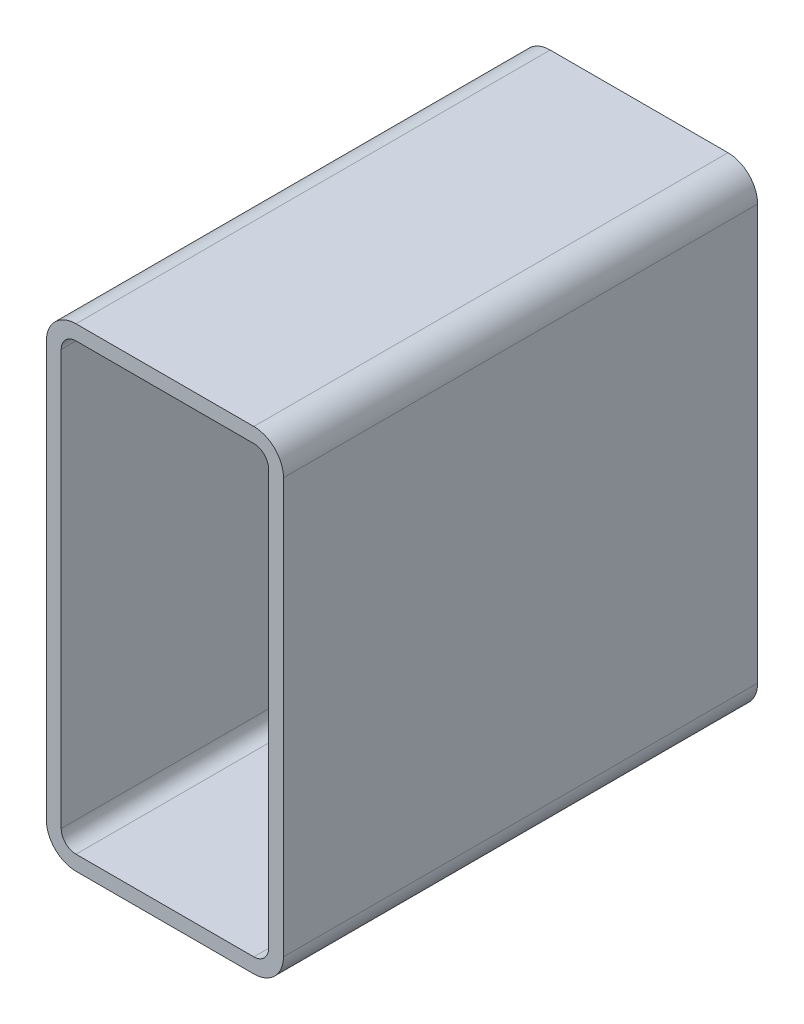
ISO-10303-21;
HEADER;
FILE_DESCRIPTION(('STEP AP214'),'2;1');
FILE_NAME('part.step','',(''),(''),'','','');
FILE_SCHEMA(('AUTOMOTIVE_DESIGN { 1 0 10303 214 1 1 1 1 }'));
ENDSEC;
DATA;
#1=APPLICATION_CONTEXT('core data for automotive mechanical design processes');
#2=APPLICATION_PROTOCOL_DEFINITION('international standard','automotive_design',2000,#1);
#3=PRODUCT_CONTEXT('',#1,'mechanical');
#4=PRODUCT('Part','Part','',(#3));
#5=PRODUCT_RELATED_PRODUCT_CATEGORY('part','',(#4));
#6=PRODUCT_DEFINITION_FORMATION('','',#4);
#7=PRODUCT_DEFINITION_CONTEXT('part definition',#1,'design');
#8=PRODUCT_DEFINITION('design','',#6,#7);
#9=PRODUCT_DEFINITION_SHAPE('','',#8);
#10=(LENGTH_UNIT() NAMED_UNIT(*) SI_UNIT(.MILLI.,.METRE.));
#11=(NAMED_UNIT(*) PLANE_ANGLE_UNIT() SI_UNIT($,.RADIAN.));
#12=(NAMED_UNIT(*) SI_UNIT($,.STERADIAN.) SOLID_ANGLE_UNIT());
#13=UNCERTAINTY_MEASURE_WITH_UNIT(LENGTH_MEASURE(1.E-05),#10,'distance_accuracy_value','');
#14=(GEOMETRIC_REPRESENTATION_CONTEXT(3) GLOBAL_UNCERTAINTY_ASSIGNED_CONTEXT((#13)) GLOBAL_UNIT_ASSIGNED_CONTEXT((#10,
#11,#12)) REPRESENTATION_CONTEXT('',''));
#15=CARTESIAN_POINT('',(0.,0.,0.));
#16=DIRECTION('',(0.,0.,1.));
#17=DIRECTION('',(1.,0.,0.));
#18=AXIS2_PLACEMENT_3D('',#15,#16,#17);
#19=CARTESIAN_POINT('',(19.0973013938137,287.624496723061,304.8));
#20=DIRECTION('',(0.,0.,1.));
#21=DIRECTION('',(1.,0.,0.));
#22=AXIS2_PLACEMENT_3D('',#19,#20,#21);
#23=PLANE('',#22);
#24=CARTESIAN_POINT('',(19.0973013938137,287.624496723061,304.8));
#25=DIRECTION('',(0.,0.,1.));
#26=DIRECTION('',(1.,0.,0.));
#27=AXIS2_PLACEMENT_3D('',#24,#25,#26);
#28=CIRCLE('',#27,19.05);
#29=CARTESIAN_POINT('',(19.0973013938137,306.674496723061,304.8));
#30=VERTEX_POINT('',#29);
#31=CARTESIAN_POINT('',(0.0473013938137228,287.624496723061,304.8));
#32=VERTEX_POINT('',#31);
#33=EDGE_CURVE('E211',#30,#32,#28,.T.);
#34=ORIENTED_EDGE('',*,*,#33,.T.);
#35=DIRECTION('',(0.,-1.,0.));
#36=VECTOR('',#35,1.);
#37=CARTESIAN_POINT('',(0.0473013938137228,20.9244967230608,304.8));
#38=LINE('',#37,#36);
#39=CARTESIAN_POINT('',(0.0473013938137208,20.9244967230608,304.8));
#40=VERTEX_POINT('',#39);
#41=EDGE_CURVE('E214',#32,#40,#38,.T.);
#42=ORIENTED_EDGE('',*,*,#41,.T.);
#43=CARTESIAN_POINT('',(19.0973013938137,20.9244967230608,304.8));
#44=DIRECTION('',(0.,0.,1.));
#45=DIRECTION('',(1.,0.,0.));
#46=AXIS2_PLACEMENT_3D('',#43,#44,#45);
#47=CIRCLE('',#46,19.05);
#48=CARTESIAN_POINT('',(19.0973013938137,1.87449672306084,304.8));
#49=VERTEX_POINT('',#48);
#50=EDGE_CURVE('E217',#40,#49,#47,.T.);
#51=ORIENTED_EDGE('',*,*,#50,.T.);
#52=DIRECTION('',(1.,0.,0.));
#53=VECTOR('',#52,1.);
#54=CARTESIAN_POINT('',(133.397301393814,1.87449672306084,304.8));
#55=LINE('',#54,#53);
#56=CARTESIAN_POINT('',(133.397301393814,1.87449672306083,304.8));
#57=VERTEX_POINT('',#56);
#58=EDGE_CURVE('E219',#49,#57,#55,.T.);
#59=ORIENTED_EDGE('',*,*,#58,.T.);
#60=CARTESIAN_POINT('',(133.397301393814,20.9244967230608,304.8));
#61=DIRECTION('',(0.,0.,1.));
#62=DIRECTION('',(1.,0.,0.));
#63=AXIS2_PLACEMENT_3D('',#60,#61,#62);
#64=CIRCLE('',#63,19.05);
#65=CARTESIAN_POINT('',(152.447301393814,20.9244967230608,304.8));
#66=VERTEX_POINT('',#65);
#67=EDGE_CURVE('E221',#57,#66,#64,.T.);
#68=ORIENTED_EDGE('',*,*,#67,.T.);
#69=DIRECTION('',(0.,1.,0.));
#70=VECTOR('',#69,1.);
#71=CARTESIAN_POINT('',(152.447301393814,287.624496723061,304.8));
#72=LINE('',#71,#70);
#73=CARTESIAN_POINT('',(152.447301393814,287.624496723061,304.8));
#74=VERTEX_POINT('',#73);
#75=EDGE_CURVE('E223',#66,#74,#72,.T.);
#76=ORIENTED_EDGE('',*,*,#75,.T.);
#77=CARTESIAN_POINT('',(133.397301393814,287.624496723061,304.8));
#78=DIRECTION('',(0.,0.,1.));
#79=DIRECTION('',(1.,0.,0.));
#80=AXIS2_PLACEMENT_3D('',#77,#78,#79);
#81=CIRCLE('',#80,19.05);
#82=CARTESIAN_POINT('',(133.397301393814,306.674496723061,304.8));
#83=VERTEX_POINT('',#82);
#84=EDGE_CURVE('E225',#74,#83,#81,.T.);
#85=ORIENTED_EDGE('',*,*,#84,.T.);
#86=DIRECTION('',(-1.,0.,0.));
#87=VECTOR('',#86,1.);
#88=CARTESIAN_POINT('',(19.0973013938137,306.674496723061,304.8));
#89=LINE('',#88,#87);
#90=EDGE_CURVE('E227',#83,#30,#89,.T.);
#91=ORIENTED_EDGE('',*,*,#90,.T.);
#92=EDGE_LOOP('',(#34,#42,#51,#59,#68,#76,#85,#91));
#93=FACE_BOUND('',#92,.T.);
#94=DIRECTION('',(0.,-1.,0.));
#95=VECTOR('',#94,1.);
#96=CARTESIAN_POINT('',(9.57230139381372,20.9244967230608,304.8));
#97=LINE('',#96,#95);
#98=CARTESIAN_POINT('',(9.57230139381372,287.624496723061,304.8));
#99=VERTEX_POINT('',#98);
#100=CARTESIAN_POINT('',(9.57230139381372,20.9244967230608,304.8));
#101=VERTEX_POINT('',#100);
#102=EDGE_CURVE('E154',#99,#101,#97,.T.);
#103=ORIENTED_EDGE('',*,*,#102,.F.);
#104=CARTESIAN_POINT('',(19.0973013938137,287.624496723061,304.8));
#105=DIRECTION('',(0.,0.,1.));
#106=DIRECTION('',(1.,0.,0.));
#107=AXIS2_PLACEMENT_3D('',#104,#105,#106);
#108=CIRCLE('',#107,9.52500000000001);
#109=CARTESIAN_POINT('',(19.0973013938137,297.149496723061,304.8));
#110=VERTEX_POINT('',#109);
#111=EDGE_CURVE('E146',#110,#99,#108,.T.);
#112=ORIENTED_EDGE('',*,*,#111,.F.);
#113=DIRECTION('',(-1.,0.,0.));
#114=VECTOR('',#113,1.);
#115=CARTESIAN_POINT('',(19.0973013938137,297.149496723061,304.8));
#116=LINE('',#115,#114);
#117=CARTESIAN_POINT('',(133.397301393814,297.149496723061,304.8));
#118=VERTEX_POINT('',#117);
#119=EDGE_CURVE('E179',#118,#110,#116,.T.);
#120=ORIENTED_EDGE('',*,*,#119,.F.);
#121=CARTESIAN_POINT('',(133.397301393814,287.624496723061,304.8));
#122=DIRECTION('',(0.,0.,1.));
#123=DIRECTION('',(1.,0.,0.));
#124=AXIS2_PLACEMENT_3D('',#121,#122,#123);
#125=CIRCLE('',#124,9.52500000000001);
#126=CARTESIAN_POINT('',(142.922301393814,287.624496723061,304.8));
#127=VERTEX_POINT('',#126);
#128=EDGE_CURVE('E177',#127,#118,#125,.T.);
#129=ORIENTED_EDGE('',*,*,#128,.F.);
#130=DIRECTION('',(0.,1.,0.));
#131=VECTOR('',#130,1.);
#132=CARTESIAN_POINT('',(142.922301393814,287.624496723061,304.8));
#133=LINE('',#132,#131);
#134=CARTESIAN_POINT('',(142.922301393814,20.9244967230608,304.8));
#135=VERTEX_POINT('',#134);
#136=EDGE_CURVE('E175',#135,#127,#133,.T.);
#137=ORIENTED_EDGE('',*,*,#136,.F.);
#138=CARTESIAN_POINT('',(133.397301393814,20.9244967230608,304.8));
#139=DIRECTION('',(0.,0.,1.));
#140=DIRECTION('',(1.,0.,0.));
#141=AXIS2_PLACEMENT_3D('',#138,#139,#140);
#142=CIRCLE('',#141,9.525);
#143=CARTESIAN_POINT('',(133.397301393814,11.3994967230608,304.8));
#144=VERTEX_POINT('',#143);
#145=EDGE_CURVE('E173',#144,#135,#142,.T.);
#146=ORIENTED_EDGE('',*,*,#145,.F.);
#147=DIRECTION('',(1.,0.,0.));
#148=VECTOR('',#147,1.);
#149=CARTESIAN_POINT('',(133.397301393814,11.3994967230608,304.8));
#150=LINE('',#149,#148);
#151=CARTESIAN_POINT('',(19.0973013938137,11.3994967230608,304.8));
#152=VERTEX_POINT('',#151);
#153=EDGE_CURVE('E169',#152,#144,#150,.T.);
#154=ORIENTED_EDGE('',*,*,#153,.F.);
#155=CARTESIAN_POINT('',(19.0973013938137,20.9244967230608,304.8));
#156=DIRECTION('',(0.,0.,1.));
#157=DIRECTION('',(1.,0.,0.));
#158=AXIS2_PLACEMENT_3D('',#155,#156,#157);
#159=CIRCLE('',#158,9.525);
#160=EDGE_CURVE('E167',#101,#152,#159,.T.);
#161=ORIENTED_EDGE('',*,*,#160,.F.);
#162=EDGE_LOOP('',(#103,#112,#120,#129,#137,#146,#154,#161));
#163=FACE_BOUND('',#162,.T.);
#164=ADVANCED_FACE('F33',(#93,#163),#23,.T.);
#165=CARTESIAN_POINT('',(19.0973013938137,287.624496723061,0.));
#166=DIRECTION('',(0.,0.,1.));
#167=DIRECTION('',(1.,0.,0.));
#168=AXIS2_PLACEMENT_3D('',#165,#166,#167);
#169=PLANE('',#168);
#170=CARTESIAN_POINT('',(19.0973013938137,287.624496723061,0.));
#171=DIRECTION('',(0.,0.,1.));
#172=DIRECTION('',(1.,0.,0.));
#173=AXIS2_PLACEMENT_3D('',#170,#171,#172);
#174=CIRCLE('',#173,19.05);
#175=CARTESIAN_POINT('',(19.0973013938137,306.674496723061,0.));
#176=VERTEX_POINT('',#175);
#177=CARTESIAN_POINT('',(0.0473013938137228,287.624496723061,0.));
#178=VERTEX_POINT('',#177);
#179=EDGE_CURVE('E162',#176,#178,#174,.T.);
#180=ORIENTED_EDGE('',*,*,#179,.F.);
#181=DIRECTION('',(-1.,0.,0.));
#182=VECTOR('',#181,1.);
#183=CARTESIAN_POINT('',(19.0973013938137,306.674496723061,0.));
#184=LINE('',#183,#182);
#185=CARTESIAN_POINT('',(133.397301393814,306.674496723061,0.));
#186=VERTEX_POINT('',#185);
#187=EDGE_CURVE('E215',#186,#176,#184,.T.);
#188=ORIENTED_EDGE('',*,*,#187,.F.);
#189=CARTESIAN_POINT('',(133.397301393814,287.624496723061,0.));
#190=DIRECTION('',(0.,0.,1.));
#191=DIRECTION('',(1.,0.,0.));
#192=AXIS2_PLACEMENT_3D('',#189,#190,#191);
#193=CIRCLE('',#192,19.05);
#194=CARTESIAN_POINT('',(152.447301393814,287.624496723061,0.));
#195=VERTEX_POINT('',#194);
#196=EDGE_CURVE('E242',#195,#186,#193,.T.);
#197=ORIENTED_EDGE('',*,*,#196,.F.);
#198=DIRECTION('',(0.,1.,0.));
#199=VECTOR('',#198,1.);
#200=CARTESIAN_POINT('',(152.447301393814,287.624496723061,0.));
#201=LINE('',#200,#199);
#202=CARTESIAN_POINT('',(152.447301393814,20.9244967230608,0.));
#203=VERTEX_POINT('',#202);
#204=EDGE_CURVE('E240',#203,#195,#201,.T.);
#205=ORIENTED_EDGE('',*,*,#204,.F.);
#206=CARTESIAN_POINT('',(133.397301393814,20.9244967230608,0.));
#207=DIRECTION('',(0.,0.,1.));
#208=DIRECTION('',(1.,0.,0.));
#209=AXIS2_PLACEMENT_3D('',#206,#207,#208);
#210=CIRCLE('',#209,19.05);
#211=CARTESIAN_POINT('',(133.397301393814,1.87449672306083,0.));
#212=VERTEX_POINT('',#211);
#213=EDGE_CURVE('E238',#212,#203,#210,.T.);
#214=ORIENTED_EDGE('',*,*,#213,.F.);
#215=DIRECTION('',(1.,0.,0.));
#216=VECTOR('',#215,1.);
#217=CARTESIAN_POINT('',(133.397301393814,1.87449672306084,0.));
#218=LINE('',#217,#216);
#219=CARTESIAN_POINT('',(19.0973013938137,1.87449672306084,0.));
#220=VERTEX_POINT('',#219);
#221=EDGE_CURVE('E236',#220,#212,#218,.T.);
#222=ORIENTED_EDGE('',*,*,#221,.F.);
#223=CARTESIAN_POINT('',(19.0973013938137,20.9244967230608,0.));
#224=DIRECTION('',(0.,0.,1.));
#225=DIRECTION('',(1.,0.,0.));
#226=AXIS2_PLACEMENT_3D('',#223,#224,#225);
#227=CIRCLE('',#226,19.05);
#228=CARTESIAN_POINT('',(0.0473013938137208,20.9244967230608,0.));
#229=VERTEX_POINT('',#228);
#230=EDGE_CURVE('E234',#229,#220,#227,.T.);
#231=ORIENTED_EDGE('',*,*,#230,.F.);
#232=DIRECTION('',(0.,-1.,0.));
#233=VECTOR('',#232,1.);
#234=CARTESIAN_POINT('',(0.0473013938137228,20.9244967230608,0.));
#235=LINE('',#234,#233);
#236=EDGE_CURVE('E232',#178,#229,#235,.T.);
#237=ORIENTED_EDGE('',*,*,#236,.F.);
#238=EDGE_LOOP('',(#180,#188,#197,#205,#214,#222,#231,#237));
#239=FACE_BOUND('',#238,.T.);
#240=CARTESIAN_POINT('',(19.0973013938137,287.624496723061,0.));
#241=DIRECTION('',(0.,0.,1.));
#242=DIRECTION('',(1.,0.,0.));
#243=AXIS2_PLACEMENT_3D('',#240,#241,#242);
#244=CIRCLE('',#243,9.52500000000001);
#245=CARTESIAN_POINT('',(19.0973013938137,297.149496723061,0.));
#246=VERTEX_POINT('',#245);
#247=CARTESIAN_POINT('',(9.57230139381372,287.624496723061,0.));
#248=VERTEX_POINT('',#247);
#249=EDGE_CURVE('E56',#246,#248,#244,.T.);
#250=ORIENTED_EDGE('',*,*,#249,.T.);
#251=DIRECTION('',(0.,-1.,0.));
#252=VECTOR('',#251,1.);
#253=CARTESIAN_POINT('',(9.57230139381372,20.9244967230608,0.));
#254=LINE('',#253,#252);
#255=CARTESIAN_POINT('',(9.57230139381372,20.9244967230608,0.));
#256=VERTEX_POINT('',#255);
#257=EDGE_CURVE('E161',#248,#256,#254,.T.);
#258=ORIENTED_EDGE('',*,*,#257,.T.);
#259=CARTESIAN_POINT('',(19.0973013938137,20.9244967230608,0.));
#260=DIRECTION('',(0.,0.,1.));
#261=DIRECTION('',(1.,0.,0.));
#262=AXIS2_PLACEMENT_3D('',#259,#260,#261);
#263=CIRCLE('',#262,9.525);
#264=CARTESIAN_POINT('',(19.0973013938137,11.3994967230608,0.));
#265=VERTEX_POINT('',#264);
#266=EDGE_CURVE('E183',#256,#265,#263,.T.);
#267=ORIENTED_EDGE('',*,*,#266,.T.);
#268=DIRECTION('',(1.,0.,0.));
#269=VECTOR('',#268,1.);
#270=CARTESIAN_POINT('',(133.397301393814,11.3994967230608,0.));
#271=LINE('',#270,#269);
#272=CARTESIAN_POINT('',(133.397301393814,11.3994967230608,0.));
#273=VERTEX_POINT('',#272);
#274=EDGE_CURVE('E186',#265,#273,#271,.T.);
#275=ORIENTED_EDGE('',*,*,#274,.T.);
#276=CARTESIAN_POINT('',(133.397301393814,20.9244967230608,0.));
#277=DIRECTION('',(0.,0.,1.));
#278=DIRECTION('',(1.,0.,0.));
#279=AXIS2_PLACEMENT_3D('',#276,#277,#278);
#280=CIRCLE('',#279,9.525);
#281=CARTESIAN_POINT('',(142.922301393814,20.9244967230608,0.));
#282=VERTEX_POINT('',#281);
#283=EDGE_CURVE('E189',#273,#282,#280,.T.);
#284=ORIENTED_EDGE('',*,*,#283,.T.);
#285=DIRECTION('',(0.,1.,0.));
#286=VECTOR('',#285,1.);
#287=CARTESIAN_POINT('',(142.922301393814,287.624496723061,0.));
#288=LINE('',#287,#286);
#289=CARTESIAN_POINT('',(142.922301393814,287.624496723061,0.));
#290=VERTEX_POINT('',#289);
#291=EDGE_CURVE('E192',#282,#290,#288,.T.);
#292=ORIENTED_EDGE('',*,*,#291,.T.);
#293=CARTESIAN_POINT('',(133.397301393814,287.624496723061,0.));
#294=DIRECTION('',(0.,0.,1.));
#295=DIRECTION('',(1.,0.,0.));
#296=AXIS2_PLACEMENT_3D('',#293,#294,#295);
#297=CIRCLE('',#296,9.52500000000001);
#298=CARTESIAN_POINT('',(133.397301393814,297.149496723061,0.));
#299=VERTEX_POINT('',#298);
#300=EDGE_CURVE('E195',#290,#299,#297,.T.);
#301=ORIENTED_EDGE('',*,*,#300,.T.);
#302=DIRECTION('',(-1.,0.,0.));
#303=VECTOR('',#302,1.);
#304=CARTESIAN_POINT('',(19.0973013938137,297.149496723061,0.));
#305=LINE('',#304,#303);
#306=EDGE_CURVE('E155',#299,#246,#305,.T.);
#307=ORIENTED_EDGE('',*,*,#306,.T.);
#308=EDGE_LOOP('',(#250,#258,#267,#275,#284,#292,#301,#307));
#309=FACE_BOUND('',#308,.T.);
#310=ADVANCED_FACE('F272',(#239,#309),#169,.F.);
#311=CARTESIAN_POINT('',(19.0973013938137,287.624496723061,304.8));
#312=DIRECTION('',(0.,0.,-1.));
#313=DIRECTION('',(-1.,0.,0.));
#314=AXIS2_PLACEMENT_3D('',#311,#312,#313);
#315=CYLINDRICAL_SURFACE('',#314,19.05);
#316=ORIENTED_EDGE('',*,*,#179,.T.);
#317=DIRECTION('',(0.,0.,-1.));
#318=VECTOR('',#317,1.);
#319=CARTESIAN_POINT('',(0.0473013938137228,287.624496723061,304.8));
#320=LINE('',#319,#318);
#321=EDGE_CURVE('E11',#32,#178,#320,.T.);
#322=ORIENTED_EDGE('',*,*,#321,.F.);
#323=ORIENTED_EDGE('',*,*,#33,.F.);
#324=DIRECTION('',(0.,0.,-1.));
#325=VECTOR('',#324,1.);
#326=CARTESIAN_POINT('',(19.0973013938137,306.674496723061,304.8));
#327=LINE('',#326,#325);
#328=EDGE_CURVE('E229',#30,#176,#327,.T.);
#329=ORIENTED_EDGE('',*,*,#328,.T.);
#330=EDGE_LOOP('',(#316,#322,#323,#329));
#331=FACE_BOUND('',#330,.T.);
#332=ADVANCED_FACE('F35',(#331),#315,.T.);
#333=CARTESIAN_POINT('',(0.0473013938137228,20.9244967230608,304.8));
#334=DIRECTION('',(1.,0.,0.));
#335=DIRECTION('',(0.,0.,-1.));
#336=AXIS2_PLACEMENT_3D('',#333,#334,#335);
#337=PLANE('',#336);
#338=ORIENTED_EDGE('',*,*,#236,.T.);
#339=DIRECTION('',(0.,0.,-1.));
#340=VECTOR('',#339,1.);
#341=CARTESIAN_POINT('',(0.0473013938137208,20.9244967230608,304.8));
#342=LINE('',#341,#340);
#343=EDGE_CURVE('E41',#40,#229,#342,.T.);
#344=ORIENTED_EDGE('',*,*,#343,.F.);
#345=ORIENTED_EDGE('',*,*,#41,.F.);
#346=ORIENTED_EDGE('',*,*,#321,.T.);
#347=EDGE_LOOP('',(#338,#344,#345,#346));
#348=FACE_BOUND('',#347,.T.);
#349=ADVANCED_FACE('F289',(#348),#337,.F.);
#350=CARTESIAN_POINT('',(19.0973013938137,20.9244967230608,304.8));
#351=DIRECTION('',(0.,0.,-1.));
#352=DIRECTION('',(-1.,0.,0.));
#353=AXIS2_PLACEMENT_3D('',#350,#351,#352);
#354=CYLINDRICAL_SURFACE('',#353,19.05);
#355=ORIENTED_EDGE('',*,*,#230,.T.);
#356=DIRECTION('',(0.,0.,-1.));
#357=VECTOR('',#356,1.);
#358=CARTESIAN_POINT('',(19.0973013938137,1.87449672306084,304.8));
#359=LINE('',#358,#357);
#360=EDGE_CURVE('E259',#49,#220,#359,.T.);
#361=ORIENTED_EDGE('',*,*,#360,.F.);
#362=ORIENTED_EDGE('',*,*,#50,.F.);
#363=ORIENTED_EDGE('',*,*,#343,.T.);
#364=EDGE_LOOP('',(#355,#361,#362,#363));
#365=FACE_BOUND('',#364,.T.);
#366=ADVANCED_FACE('F266',(#365),#354,.T.);
#367=CARTESIAN_POINT('',(133.397301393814,1.87449672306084,304.8));
#368=DIRECTION('',(0.,1.,0.));
#369=DIRECTION('',(0.,0.,1.));
#370=AXIS2_PLACEMENT_3D('',#367,#368,#369);
#371=PLANE('',#370);
#372=ORIENTED_EDGE('',*,*,#221,.T.);
#373=DIRECTION('',(0.,0.,-1.));
#374=VECTOR('',#373,1.);
#375=CARTESIAN_POINT('',(133.397301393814,1.87449672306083,304.8));
#376=LINE('',#375,#374);
#377=EDGE_CURVE('E256',#57,#212,#376,.T.);
#378=ORIENTED_EDGE('',*,*,#377,.F.);
#379=ORIENTED_EDGE('',*,*,#58,.F.);
#380=ORIENTED_EDGE('',*,*,#360,.T.);
#381=EDGE_LOOP('',(#372,#378,#379,#380));
#382=FACE_BOUND('',#381,.T.);
#383=ADVANCED_FACE('F278',(#382),#371,.F.);
#384=CARTESIAN_POINT('',(133.397301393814,20.9244967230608,304.8));
#385=DIRECTION('',(0.,0.,-1.));
#386=DIRECTION('',(-1.,0.,0.));
#387=AXIS2_PLACEMENT_3D('',#384,#385,#386);
#388=CYLINDRICAL_SURFACE('',#387,19.05);
#389=ORIENTED_EDGE('',*,*,#213,.T.);
#390=DIRECTION('',(0.,0.,-1.));
#391=VECTOR('',#390,1.);
#392=CARTESIAN_POINT('',(152.447301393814,20.9244967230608,304.8));
#393=LINE('',#392,#391);
#394=EDGE_CURVE('E253',#66,#203,#393,.T.);
#395=ORIENTED_EDGE('',*,*,#394,.F.);
#396=ORIENTED_EDGE('',*,*,#67,.F.);
#397=ORIENTED_EDGE('',*,*,#377,.T.);
#398=EDGE_LOOP('',(#389,#395,#396,#397));
#399=FACE_BOUND('',#398,.T.);
#400=ADVANCED_FACE('F282',(#399),#388,.T.);
#401=CARTESIAN_POINT('',(152.447301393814,287.624496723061,304.8));
#402=DIRECTION('',(-1.,0.,0.));
#403=DIRECTION('',(0.,0.,1.));
#404=AXIS2_PLACEMENT_3D('',#401,#402,#403);
#405=PLANE('',#404);
#406=ORIENTED_EDGE('',*,*,#204,.T.);
#407=DIRECTION('',(0.,0.,-1.));
#408=VECTOR('',#407,1.);
#409=CARTESIAN_POINT('',(152.447301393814,287.624496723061,304.8));
#410=LINE('',#409,#408);
#411=EDGE_CURVE('E250',#74,#195,#410,.T.);
#412=ORIENTED_EDGE('',*,*,#411,.F.);
#413=ORIENTED_EDGE('',*,*,#75,.F.);
#414=ORIENTED_EDGE('',*,*,#394,.T.);
#415=EDGE_LOOP('',(#406,#412,#413,#414));
#416=FACE_BOUND('',#415,.T.);
#417=ADVANCED_FACE('F302',(#416),#405,.F.);
#418=CARTESIAN_POINT('',(133.397301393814,287.624496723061,304.8));
#419=DIRECTION('',(0.,0.,-1.));
#420=DIRECTION('',(-1.,0.,0.));
#421=AXIS2_PLACEMENT_3D('',#418,#419,#420);
#422=CYLINDRICAL_SURFACE('',#421,19.05);
#423=ORIENTED_EDGE('',*,*,#196,.T.);
#424=DIRECTION('',(0.,0.,-1.));
#425=VECTOR('',#424,1.);
#426=CARTESIAN_POINT('',(133.397301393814,306.674496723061,304.8));
#427=LINE('',#426,#425);
#428=EDGE_CURVE('E247',#83,#186,#427,.T.);
#429=ORIENTED_EDGE('',*,*,#428,.F.);
#430=ORIENTED_EDGE('',*,*,#84,.F.);
#431=ORIENTED_EDGE('',*,*,#411,.T.);
#432=EDGE_LOOP('',(#423,#429,#430,#431));
#433=FACE_BOUND('',#432,.T.);
#434=ADVANCED_FACE('F300',(#433),#422,.T.);
#435=CARTESIAN_POINT('',(19.0973013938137,306.674496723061,304.8));
#436=DIRECTION('',(0.,-1.,0.));
#437=DIRECTION('',(0.,0.,-1.));
#438=AXIS2_PLACEMENT_3D('',#435,#436,#437);
#439=PLANE('',#438);
#440=ORIENTED_EDGE('',*,*,#187,.T.);
#441=ORIENTED_EDGE('',*,*,#328,.F.);
#442=ORIENTED_EDGE('',*,*,#90,.F.);
#443=ORIENTED_EDGE('',*,*,#428,.T.);
#444=EDGE_LOOP('',(#440,#441,#442,#443));
#445=FACE_BOUND('',#444,.T.);
#446=ADVANCED_FACE('F295',(#445),#439,.F.);
#447=CARTESIAN_POINT('',(19.0973013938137,287.624496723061,304.8));
#448=DIRECTION('',(0.,0.,-1.));
#449=DIRECTION('',(-1.,0.,0.));
#450=AXIS2_PLACEMENT_3D('',#447,#448,#449);
#451=CYLINDRICAL_SURFACE('',#450,9.52500000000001);
#452=ORIENTED_EDGE('',*,*,#249,.F.);
#453=DIRECTION('',(0.,0.,-1.));
#454=VECTOR('',#453,1.);
#455=CARTESIAN_POINT('',(19.0973013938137,297.149496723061,304.8));
#456=LINE('',#455,#454);
#457=EDGE_CURVE('E150',#110,#246,#456,.T.);
#458=ORIENTED_EDGE('',*,*,#457,.F.);
#459=ORIENTED_EDGE('',*,*,#111,.T.);
#460=DIRECTION('',(0.,0.,-1.));
#461=VECTOR('',#460,1.);
#462=CARTESIAN_POINT('',(9.57230139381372,287.624496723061,304.8));
#463=LINE('',#462,#461);
#464=EDGE_CURVE('E149',#99,#248,#463,.T.);
#465=ORIENTED_EDGE('',*,*,#464,.T.);
#466=EDGE_LOOP('',(#452,#458,#459,#465));
#467=FACE_BOUND('',#466,.T.);
#468=ADVANCED_FACE('F148',(#467),#451,.F.);
#469=CARTESIAN_POINT('',(9.57230139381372,20.9244967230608,304.8));
#470=DIRECTION('',(1.,0.,0.));
#471=DIRECTION('',(0.,0.,-1.));
#472=AXIS2_PLACEMENT_3D('',#469,#470,#471);
#473=PLANE('',#472);
#474=ORIENTED_EDGE('',*,*,#257,.F.);
#475=ORIENTED_EDGE('',*,*,#464,.F.);
#476=ORIENTED_EDGE('',*,*,#102,.T.);
#477=DIRECTION('',(0.,0.,-1.));
#478=VECTOR('',#477,1.);
#479=CARTESIAN_POINT('',(9.57230139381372,20.9244967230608,304.8));
#480=LINE('',#479,#478);
#481=EDGE_CURVE('E163',#101,#256,#480,.T.);
#482=ORIENTED_EDGE('',*,*,#481,.T.);
#483=EDGE_LOOP('',(#474,#475,#476,#482));
#484=FACE_BOUND('',#483,.T.);
#485=ADVANCED_FACE('F158',(#484),#473,.T.);
#486=CARTESIAN_POINT('',(19.0973013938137,20.9244967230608,304.8));
#487=DIRECTION('',(0.,0.,-1.));
#488=DIRECTION('',(-1.,0.,0.));
#489=AXIS2_PLACEMENT_3D('',#486,#487,#488);
#490=CYLINDRICAL_SURFACE('',#489,9.525);
#491=ORIENTED_EDGE('',*,*,#266,.F.);
#492=ORIENTED_EDGE('',*,*,#481,.F.);
#493=ORIENTED_EDGE('',*,*,#160,.T.);
#494=DIRECTION('',(0.,0.,-1.));
#495=VECTOR('',#494,1.);
#496=CARTESIAN_POINT('',(19.0973013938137,11.3994967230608,304.8));
#497=LINE('',#496,#495);
#498=EDGE_CURVE('E208',#152,#265,#497,.T.);
#499=ORIENTED_EDGE('',*,*,#498,.T.);
#500=EDGE_LOOP('',(#491,#492,#493,#499));
#501=FACE_BOUND('',#500,.T.);
#502=ADVANCED_FACE('F327',(#501),#490,.F.);
#503=CARTESIAN_POINT('',(133.397301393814,11.3994967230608,304.8));
#504=DIRECTION('',(0.,1.,0.));
#505=DIRECTION('',(0.,0.,1.));
#506=AXIS2_PLACEMENT_3D('',#503,#504,#505);
#507=PLANE('',#506);
#508=ORIENTED_EDGE('',*,*,#274,.F.);
#509=ORIENTED_EDGE('',*,*,#498,.F.);
#510=ORIENTED_EDGE('',*,*,#153,.T.);
#511=DIRECTION('',(0.,0.,-1.));
#512=VECTOR('',#511,1.);
#513=CARTESIAN_POINT('',(133.397301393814,11.3994967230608,304.8));
#514=LINE('',#513,#512);
#515=EDGE_CURVE('E206',#144,#273,#514,.T.);
#516=ORIENTED_EDGE('',*,*,#515,.T.);
#517=EDGE_LOOP('',(#508,#509,#510,#516));
#518=FACE_BOUND('',#517,.T.);
#519=ADVANCED_FACE('F331',(#518),#507,.T.);
#520=CARTESIAN_POINT('',(133.397301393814,20.9244967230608,304.8));
#521=DIRECTION('',(0.,0.,-1.));
#522=DIRECTION('',(-1.,0.,0.));
#523=AXIS2_PLACEMENT_3D('',#520,#521,#522);
#524=CYLINDRICAL_SURFACE('',#523,9.525);
#525=ORIENTED_EDGE('',*,*,#283,.F.);
#526=ORIENTED_EDGE('',*,*,#515,.F.);
#527=ORIENTED_EDGE('',*,*,#145,.T.);
#528=DIRECTION('',(0.,0.,-1.));
#529=VECTOR('',#528,1.);
#530=CARTESIAN_POINT('',(142.922301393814,20.9244967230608,304.8));
#531=LINE('',#530,#529);
#532=EDGE_CURVE('E204',#135,#282,#531,.T.);
#533=ORIENTED_EDGE('',*,*,#532,.T.);
#534=EDGE_LOOP('',(#525,#526,#527,#533));
#535=FACE_BOUND('',#534,.T.);
#536=ADVANCED_FACE('F337',(#535),#524,.F.);
#537=CARTESIAN_POINT('',(142.922301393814,287.624496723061,304.8));
#538=DIRECTION('',(-1.,0.,0.));
#539=DIRECTION('',(0.,0.,1.));
#540=AXIS2_PLACEMENT_3D('',#537,#538,#539);
#541=PLANE('',#540);
#542=ORIENTED_EDGE('',*,*,#291,.F.);
#543=ORIENTED_EDGE('',*,*,#532,.F.);
#544=ORIENTED_EDGE('',*,*,#136,.T.);
#545=DIRECTION('',(0.,0.,-1.));
#546=VECTOR('',#545,1.);
#547=CARTESIAN_POINT('',(142.922301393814,287.624496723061,304.8));
#548=LINE('',#547,#546);
#549=EDGE_CURVE('E202',#127,#290,#548,.T.);
#550=ORIENTED_EDGE('',*,*,#549,.T.);
#551=EDGE_LOOP('',(#542,#543,#544,#550));
#552=FACE_BOUND('',#551,.T.);
#553=ADVANCED_FACE('F341',(#552),#541,.T.);
#554=CARTESIAN_POINT('',(133.397301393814,287.624496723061,304.8));
#555=DIRECTION('',(0.,0.,-1.));
#556=DIRECTION('',(-1.,0.,0.));
#557=AXIS2_PLACEMENT_3D('',#554,#555,#556);
#558=CYLINDRICAL_SURFACE('',#557,9.52500000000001);
#559=ORIENTED_EDGE('',*,*,#300,.F.);
#560=ORIENTED_EDGE('',*,*,#549,.F.);
#561=ORIENTED_EDGE('',*,*,#128,.T.);
#562=DIRECTION('',(0.,0.,-1.));
#563=VECTOR('',#562,1.);
#564=CARTESIAN_POINT('',(133.397301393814,297.149496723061,304.8));
#565=LINE('',#564,#563);
#566=EDGE_CURVE('E48',#118,#299,#565,.T.);
#567=ORIENTED_EDGE('',*,*,#566,.T.);
#568=EDGE_LOOP('',(#559,#560,#561,#567));
#569=FACE_BOUND('',#568,.T.);
#570=ADVANCED_FACE('F345',(#569),#558,.F.);
#571=CARTESIAN_POINT('',(19.0973013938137,297.149496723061,304.8));
#572=DIRECTION('',(0.,-1.,0.));
#573=DIRECTION('',(0.,0.,-1.));
#574=AXIS2_PLACEMENT_3D('',#571,#572,#573);
#575=PLANE('',#574);
#576=ORIENTED_EDGE('',*,*,#306,.F.);
#577=ORIENTED_EDGE('',*,*,#566,.F.);
#578=ORIENTED_EDGE('',*,*,#119,.T.);
#579=ORIENTED_EDGE('',*,*,#457,.T.);
#580=EDGE_LOOP('',(#576,#577,#578,#579));
#581=FACE_BOUND('',#580,.T.);
#582=ADVANCED_FACE('F349',(#581),#575,.T.);
#583=CLOSED_SHELL('',(#164,#310,#332,#349,#366,#383,#400,#417,#434,#446,#468,#485,#502,#519,
#536,#553,#570,#582));
#584=MANIFOLD_SOLID_BREP('B2',#583);
#585=ADVANCED_BREP_SHAPE_REPRESENTATION('',(#18,#584),#14);
#586=SHAPE_DEFINITION_REPRESENTATION(#9,#585);
ENDSEC;
END-ISO-10303-21;
